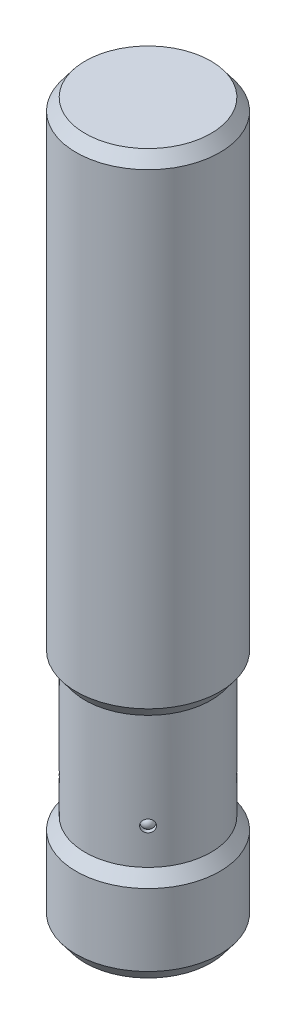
ISO-10303-21;
HEADER;
FILE_DESCRIPTION(('STEP AP214'),'2;1');
FILE_NAME('part.step','',(''),(''),'','','');
FILE_SCHEMA(('AUTOMOTIVE_DESIGN { 1 0 10303 214 1 1 1 1 }'));
ENDSEC;
DATA;
#1=APPLICATION_CONTEXT('core data for automotive mechanical design processes');
#2=APPLICATION_PROTOCOL_DEFINITION('international standard','automotive_design',2000,#1);
#3=PRODUCT_CONTEXT('',#1,'mechanical');
#4=PRODUCT('Part','Part','',(#3));
#5=PRODUCT_RELATED_PRODUCT_CATEGORY('part','',(#4));
#6=PRODUCT_DEFINITION_FORMATION('','',#4);
#7=PRODUCT_DEFINITION_CONTEXT('part definition',#1,'design');
#8=PRODUCT_DEFINITION('design','',#6,#7);
#9=PRODUCT_DEFINITION_SHAPE('','',#8);
#10=(LENGTH_UNIT() NAMED_UNIT(*) SI_UNIT(.MILLI.,.METRE.));
#11=(NAMED_UNIT(*) PLANE_ANGLE_UNIT() SI_UNIT($,.RADIAN.));
#12=(NAMED_UNIT(*) SI_UNIT($,.STERADIAN.) SOLID_ANGLE_UNIT());
#13=UNCERTAINTY_MEASURE_WITH_UNIT(LENGTH_MEASURE(1.E-05),#10,'distance_accuracy_value','');
#14=(GEOMETRIC_REPRESENTATION_CONTEXT(3) GLOBAL_UNCERTAINTY_ASSIGNED_CONTEXT((#13)) GLOBAL_UNIT_ASSIGNED_CONTEXT((#10,
#11,#12)) REPRESENTATION_CONTEXT('',''));
#15=CARTESIAN_POINT('',(0.,0.,0.));
#16=DIRECTION('',(0.,0.,1.));
#17=DIRECTION('',(1.,0.,0.));
#18=AXIS2_PLACEMENT_3D('',#15,#16,#17);
#19=CARTESIAN_POINT('',(5.12652416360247,-49.,-5.12652416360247));
#20=DIRECTION('',(-0.707106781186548,0.,0.707106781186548));
#21=DIRECTION('',(0.707106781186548,0.,0.707106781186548));
#22=AXIS2_PLACEMENT_3D('',#19,#20,#21);
#23=CYLINDRICAL_SURFACE('',#22,0.5);
#24=CARTESIAN_POINT('',(4.04898976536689,-49.,-3.34188298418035));
#25=CARTESIAN_POINT('',(4.04898851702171,-48.9720000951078,-3.34188493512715));
#26=CARTESIAN_POINT('',(4.04748142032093,-48.9439764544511,-3.34371311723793));
#27=CARTESIAN_POINT('',(4.04147412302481,-48.8886799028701,-3.35097120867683));
#28=CARTESIAN_POINT('',(4.03696762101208,-48.8614086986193,-3.3564087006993));
#29=CARTESIAN_POINT('',(4.02505422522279,-48.8084628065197,-3.37068604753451));
#30=CARTESIAN_POINT('',(4.01765015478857,-48.7827865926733,-3.37952259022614));
#31=CARTESIAN_POINT('',(4.00009662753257,-48.7337381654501,-3.40028098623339));
#32=CARTESIAN_POINT('',(3.98994837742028,-48.7103649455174,-3.41220148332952));
#33=CARTESIAN_POINT('',(3.96708199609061,-48.6664935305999,-3.43875959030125));
#34=CARTESIAN_POINT('',(3.95435615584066,-48.6460042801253,-3.45340533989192));
#35=CARTESIAN_POINT('',(3.92662928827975,-48.6085587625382,-3.48489909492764));
#36=CARTESIAN_POINT('',(3.91162804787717,-48.5916028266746,-3.50174730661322));
#37=CARTESIAN_POINT('',(3.87966391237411,-48.5616771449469,-3.53712828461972));
#38=CARTESIAN_POINT('',(3.86269738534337,-48.5487149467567,-3.55566415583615));
#39=CARTESIAN_POINT('',(3.82723947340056,-48.527193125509,-3.59380233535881));
#40=CARTESIAN_POINT('',(3.80874813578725,-48.5186333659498,-3.61340461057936));
#41=CARTESIAN_POINT('',(3.77077872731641,-48.5061845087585,-3.65300939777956));
#42=CARTESIAN_POINT('',(3.75130383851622,-48.5022812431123,-3.67301050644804));
#43=CARTESIAN_POINT('',(3.71184944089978,-48.4992123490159,-3.71287760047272));
#44=CARTESIAN_POINT('',(3.69186994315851,-48.5000466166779,-3.73274358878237));
#45=CARTESIAN_POINT('',(3.65204719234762,-48.5064175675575,-3.7717138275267));
#46=CARTESIAN_POINT('',(3.63220370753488,-48.5119389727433,-3.7908203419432));
#47=CARTESIAN_POINT('',(3.59317935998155,-48.5275037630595,-3.82783042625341));
#48=CARTESIAN_POINT('',(3.5739985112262,-48.5375472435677,-3.84573397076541));
#49=CARTESIAN_POINT('',(3.53686126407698,-48.5618883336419,-3.87991637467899));
#50=CARTESIAN_POINT('',(3.51890691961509,-48.5761928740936,-3.89619252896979));
#51=CARTESIAN_POINT('',(3.4848303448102,-48.608643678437,-3.92670107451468));
#52=CARTESIAN_POINT('',(3.46870801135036,-48.6267897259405,-3.94093358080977));
#53=CARTESIAN_POINT('',(3.43876588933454,-48.6664909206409,-3.96708793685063));
#54=CARTESIAN_POINT('',(3.42495503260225,-48.6880586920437,-3.97900085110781));
#55=CARTESIAN_POINT('',(3.40017462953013,-48.7339596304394,-4.00019742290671));
#56=CARTESIAN_POINT('',(3.38920640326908,-48.7582940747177,-4.00947985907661));
#57=CARTESIAN_POINT('',(3.37049477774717,-48.8090557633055,-4.02522237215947));
#58=CARTESIAN_POINT('',(3.36275462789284,-48.8354850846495,-4.03167960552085));
#59=CARTESIAN_POINT('',(3.35080848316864,-48.8896214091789,-4.04161404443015));
#60=CARTESIAN_POINT('',(3.34659498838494,-48.9173255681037,-4.04509757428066));
#61=CARTESIAN_POINT('',(3.34265918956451,-48.9634414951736,-4.04834926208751));
#62=CARTESIAN_POINT('',(3.34188171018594,-48.9817156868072,-4.04899058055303));
#63=CARTESIAN_POINT('',(3.34188493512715,-49.0279999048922,-4.04898851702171));
#64=CARTESIAN_POINT('',(3.34371311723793,-49.0560235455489,-4.04748142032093));
#65=CARTESIAN_POINT('',(3.35097120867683,-49.1113200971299,-4.04147412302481));
#66=CARTESIAN_POINT('',(3.3564087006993,-49.1385913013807,-4.03696762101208));
#67=CARTESIAN_POINT('',(3.37068604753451,-49.1915371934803,-4.02505422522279));
#68=CARTESIAN_POINT('',(3.37952259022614,-49.2172134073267,-4.01765015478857));
#69=CARTESIAN_POINT('',(3.40028098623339,-49.2662618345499,-4.00009662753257));
#70=CARTESIAN_POINT('',(3.41220148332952,-49.2896350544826,-3.98994837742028));
#71=CARTESIAN_POINT('',(3.43875959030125,-49.3335064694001,-3.96708199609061));
#72=CARTESIAN_POINT('',(3.45340533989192,-49.3539957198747,-3.95435615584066));
#73=CARTESIAN_POINT('',(3.48489909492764,-49.3914412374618,-3.92662928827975));
#74=CARTESIAN_POINT('',(3.50174730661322,-49.4083971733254,-3.91162804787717));
#75=CARTESIAN_POINT('',(3.53712828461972,-49.4383228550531,-3.87966391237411));
#76=CARTESIAN_POINT('',(3.55566415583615,-49.4512850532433,-3.86269738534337));
#77=CARTESIAN_POINT('',(3.59380233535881,-49.472806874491,-3.82723947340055));
#78=CARTESIAN_POINT('',(3.61340461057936,-49.4813666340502,-3.80874813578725));
#79=CARTESIAN_POINT('',(3.65300939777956,-49.4938154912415,-3.77077872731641));
#80=CARTESIAN_POINT('',(3.67301050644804,-49.4977187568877,-3.75130383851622));
#81=CARTESIAN_POINT('',(3.71287760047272,-49.5007876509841,-3.71184944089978));
#82=CARTESIAN_POINT('',(3.73274358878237,-49.4999533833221,-3.69186994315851));
#83=CARTESIAN_POINT('',(3.7717138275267,-49.4935824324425,-3.65204719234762));
#84=CARTESIAN_POINT('',(3.7908203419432,-49.4880610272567,-3.63220370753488));
#85=CARTESIAN_POINT('',(3.82783042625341,-49.4724962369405,-3.59317935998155));
#86=CARTESIAN_POINT('',(3.84573397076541,-49.4624527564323,-3.5739985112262));
#87=CARTESIAN_POINT('',(3.87991637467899,-49.4381116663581,-3.53686126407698));
#88=CARTESIAN_POINT('',(3.89619252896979,-49.4238071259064,-3.51890691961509));
#89=CARTESIAN_POINT('',(3.92670107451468,-49.391356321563,-3.4848303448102));
#90=CARTESIAN_POINT('',(3.94093358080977,-49.3732102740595,-3.46870801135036));
#91=CARTESIAN_POINT('',(3.96708793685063,-49.3335090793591,-3.43876588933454));
#92=CARTESIAN_POINT('',(3.97900085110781,-49.3119413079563,-3.42495503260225));
#93=CARTESIAN_POINT('',(4.00019742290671,-49.2660403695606,-3.40017462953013));
#94=CARTESIAN_POINT('',(4.00947985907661,-49.2417059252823,-3.38920640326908));
#95=CARTESIAN_POINT('',(4.02522237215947,-49.1909442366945,-3.37049477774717));
#96=CARTESIAN_POINT('',(4.03167960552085,-49.1645149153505,-3.36275462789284));
#97=CARTESIAN_POINT('',(4.04161404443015,-49.1103785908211,-3.35080848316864));
#98=CARTESIAN_POINT('',(4.04509757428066,-49.0826744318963,-3.34659498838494));
#99=CARTESIAN_POINT('',(4.04834926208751,-49.0365585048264,-3.34265918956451));
#100=CARTESIAN_POINT('',(4.04899058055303,-49.0182843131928,-3.34188171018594));
#101=CARTESIAN_POINT('',(4.04898976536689,-49.,-3.34188298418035));
#102=B_SPLINE_CURVE_WITH_KNOTS('',3,(#24,#25,#26,#27,#28,#29,#30,#31,#32,#33,#34,#35,#36,#37,
#38,#39,#40,#41,#42,#43,#44,#45,#46,#47,#48,#49,#50,#51,#52,#53,#54,#55,#56,#57,#58,#59,#60,#61,
#62,#63,#64,#65,#66,#67,#68,#69,#70,#71,#72,#73,#74,#75,#76,#77,#78,#79,#80,#81,#82,#83,#84,#85,
#86,#87,#88,#89,#90,#91,#92,#93,#94,#95,#96,#97,#98,#99,#100,#101),.UNSPECIFIED.,.T.,.F.,(4,2,2,
2,2,2,2,2,2,2,2,2,2,2,2,2,2,2,2,2,2,2,2,2,2,2,2,2,2,2,2,2,2,2,2,2,2,2,4),(0.,0.0839416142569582,
0.16806013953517,0.252096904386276,0.336096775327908,0.420351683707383,0.504614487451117,
0.589035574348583,0.673454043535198,0.75761499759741,0.841774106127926,0.925659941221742,
1.00954754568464,1.09357235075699,1.17759242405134,1.2619300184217,1.34630670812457,
1.43076812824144,1.51504946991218,1.56986446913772,1.65380608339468,1.73792460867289,
1.82196137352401,1.90596124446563,1.99021615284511,2.07447895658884,2.15890004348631,
2.24331851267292,2.32747946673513,2.41163857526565,2.49552441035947,2.57941201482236,
2.66343681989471,2.74745689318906,2.83179448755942,2.91617117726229,3.00063259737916,
3.0849139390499,3.13972893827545),.UNSPECIFIED.);
#103=CARTESIAN_POINT('',(4.04898976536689,-49.,-3.34188298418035));
#104=VERTEX_POINT('',#103);
#105=EDGE_CURVE('E95',#104,#104,#102,.T.);
#106=ORIENTED_EDGE('',*,*,#105,.F.);
#107=EDGE_LOOP('',(#106));
#108=FACE_BOUND('',#107,.T.);
#109=CARTESIAN_POINT('',(3.3587572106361,-49.,-3.3587572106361));
#110=DIRECTION('',(-0.707106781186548,0.,0.707106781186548));
#111=DIRECTION('',(0.707106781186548,0.,0.707106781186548));
#112=AXIS2_PLACEMENT_3D('',#109,#110,#111);
#113=CIRCLE('',#112,0.5);
#114=CARTESIAN_POINT('',(3.00520382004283,-49.,-3.71231060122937));
#115=VERTEX_POINT('',#114);
#116=EDGE_CURVE('E11',#115,#115,#113,.T.);
#117=ORIENTED_EDGE('',*,*,#116,.T.);
#118=EDGE_LOOP('',(#117));
#119=FACE_BOUND('',#118,.T.);
#120=ADVANCED_FACE('F16',(#108,#119),#23,.F.);
#121=CARTESIAN_POINT('',(-2.625,-60.,0.));
#122=DIRECTION('',(0.,-1.,0.));
#123=DIRECTION('',(0.,0.,-1.));
#124=AXIS2_PLACEMENT_3D('',#121,#122,#123);
#125=PLANE('',#124);
#126=CARTESIAN_POINT('',(0.,-60.0000000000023,0.));
#127=DIRECTION('',(0.,1.,0.));
#128=DIRECTION('',(0.,0.,1.));
#129=AXIS2_PLACEMENT_3D('',#126,#127,#128);
#130=CIRCLE('',#129,5.25000000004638);
#131=CARTESIAN_POINT('',(0.,-60.0000000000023,5.25000000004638));
#132=VERTEX_POINT('',#131);
#133=EDGE_CURVE('E93',#132,#132,#130,.T.);
#134=ORIENTED_EDGE('',*,*,#133,.F.);
#135=EDGE_LOOP('',(#134));
#136=FACE_BOUND('',#135,.T.);
#137=ADVANCED_FACE('F83',(#136),#125,.T.);
#138=CARTESIAN_POINT('',(0.,-59.0000000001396,0.));
#139=DIRECTION('',(0.,1.,0.));
#140=DIRECTION('',(0.,0.,1.));
#141=AXIS2_PLACEMENT_3D('',#138,#139,#140);
#142=CONICAL_SURFACE('',#141,5.99999999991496,0.643501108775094);
#143=ORIENTED_EDGE('',*,*,#133,.T.);
#144=EDGE_LOOP('',(#143));
#145=FACE_BOUND('',#144,.T.);
#146=CARTESIAN_POINT('',(0.,-59.,0.));
#147=DIRECTION('',(0.,-1.,0.));
#148=DIRECTION('',(0.,0.,-1.));
#149=AXIS2_PLACEMENT_3D('',#146,#147,#148);
#150=CIRCLE('',#149,6.);
#151=CARTESIAN_POINT('',(0.,-59.,-6.));
#152=VERTEX_POINT('',#151);
#153=EDGE_CURVE('E94',#152,#152,#150,.F.);
#154=ORIENTED_EDGE('',*,*,#153,.F.);
#155=EDGE_LOOP('',(#154));
#156=FACE_BOUND('',#155,.T.);
#157=ADVANCED_FACE('F80',(#145,#156),#142,.T.);
#158=CARTESIAN_POINT('',(-3.3587572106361,-49.,-3.3587572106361));
#159=DIRECTION('',(1.,0.,0.));
#160=DIRECTION('',(0.,1.,0.));
#161=AXIS2_PLACEMENT_3D('',#158,#159,#160);
#162=SPHERICAL_SURFACE('',#161,0.5);
#163=CARTESIAN_POINT('',(-3.8587572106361,-49.,-3.3587572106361));
#164=VERTEX_POINT('',#163);
#165=VERTEX_LOOP('',#164);
#166=FACE_BOUND('',#165,.T.);
#167=CARTESIAN_POINT('',(-3.3587572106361,-49.,-3.3587572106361));
#168=DIRECTION('',(0.707106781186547,0.,0.707106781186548));
#169=DIRECTION('',(0.707106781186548,0.,-0.707106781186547));
#170=AXIS2_PLACEMENT_3D('',#167,#168,#169);
#171=CIRCLE('',#170,0.5);
#172=CARTESIAN_POINT('',(-3.00520382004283,-49.,-3.71231060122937));
#173=VERTEX_POINT('',#172);
#174=EDGE_CURVE('E98',#173,#173,#171,.F.);
#175=ORIENTED_EDGE('',*,*,#174,.T.);
#176=EDGE_LOOP('',(#175));
#177=FACE_BOUND('',#176,.T.);
#178=ADVANCED_FACE('F54',(#166,#177),#162,.T.);
#179=CARTESIAN_POINT('',(0.,-56.,0.));
#180=DIRECTION('',(0.,-1.,0.));
#181=DIRECTION('',(0.,0.,-1.));
#182=AXIS2_PLACEMENT_3D('',#179,#180,#181);
#183=CYLINDRICAL_SURFACE('',#182,6.);
#184=ORIENTED_EDGE('',*,*,#153,.T.);
#185=EDGE_LOOP('',(#184));
#186=FACE_BOUND('',#185,.T.);
#187=CARTESIAN_POINT('',(0.,-52.9999999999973,0.));
#188=DIRECTION('',(0.,-1.,0.));
#189=DIRECTION('',(-1.,0.,0.));
#190=AXIS2_PLACEMENT_3D('',#187,#188,#189);
#191=CIRCLE('',#190,5.99999999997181);
#192=CARTESIAN_POINT('',(-5.99999999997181,-52.9999999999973,0.));
#193=VERTEX_POINT('',#192);
#194=EDGE_CURVE('E108',#193,#193,#191,.F.);
#195=ORIENTED_EDGE('',*,*,#194,.F.);
#196=EDGE_LOOP('',(#195));
#197=FACE_BOUND('',#196,.T.);
#198=ADVANCED_FACE('F43',(#186,#197),#183,.T.);
#199=CARTESIAN_POINT('',(3.3587572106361,-49.,3.3587572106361));
#200=DIRECTION('',(1.,0.,0.));
#201=DIRECTION('',(0.,1.,0.));
#202=AXIS2_PLACEMENT_3D('',#199,#200,#201);
#203=SPHERICAL_SURFACE('',#202,0.5);
#204=CARTESIAN_POINT('',(3.3587572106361,-49.,3.3587572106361));
#205=DIRECTION('',(-0.707106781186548,0.,-0.707106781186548));
#206=DIRECTION('',(-0.707106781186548,0.,0.707106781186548));
#207=AXIS2_PLACEMENT_3D('',#204,#205,#206);
#208=CIRCLE('',#207,0.5);
#209=CARTESIAN_POINT('',(3.00520382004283,-49.,3.71231060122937));
#210=VERTEX_POINT('',#209);
#211=EDGE_CURVE('E111',#210,#210,#208,.F.);
#212=ORIENTED_EDGE('',*,*,#211,.T.);
#213=EDGE_LOOP('',(#212));
#214=FACE_BOUND('',#213,.T.);
#215=CARTESIAN_POINT('',(3.8587572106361,-49.,3.3587572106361));
#216=VERTEX_POINT('',#215);
#217=VERTEX_LOOP('',#216);
#218=FACE_BOUND('',#217,.T.);
#219=ADVANCED_FACE('F40',(#214,#218),#203,.T.);
#220=CARTESIAN_POINT('',(-3.3587572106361,-49.,3.3587572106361));
#221=DIRECTION('',(1.,0.,0.));
#222=DIRECTION('',(0.,1.,0.));
#223=AXIS2_PLACEMENT_3D('',#220,#221,#222);
#224=SPHERICAL_SURFACE('',#223,0.5);
#225=CARTESIAN_POINT('',(-3.3587572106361,-49.,3.3587572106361));
#226=DIRECTION('',(0.707106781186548,0.,-0.707106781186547));
#227=DIRECTION('',(-0.707106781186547,0.,-0.707106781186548));
#228=AXIS2_PLACEMENT_3D('',#225,#226,#227);
#229=CIRCLE('',#228,0.5);
#230=CARTESIAN_POINT('',(-3.71231060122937,-49.,3.00520382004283));
#231=VERTEX_POINT('',#230);
#232=EDGE_CURVE('E113',#231,#231,#229,.F.);
#233=ORIENTED_EDGE('',*,*,#232,.T.);
#234=EDGE_LOOP('',(#233));
#235=FACE_BOUND('',#234,.T.);
#236=CARTESIAN_POINT('',(-3.8587572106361,-49.,3.3587572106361));
#237=VERTEX_POINT('',#236);
#238=VERTEX_LOOP('',#237);
#239=FACE_BOUND('',#238,.T.);
#240=ADVANCED_FACE('F42',(#235,#239),#224,.T.);
#241=CARTESIAN_POINT('',(-5.12652416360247,-49.,-5.12652416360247));
#242=DIRECTION('',(0.707106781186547,0.,0.707106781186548));
#243=DIRECTION('',(0.707106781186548,0.,-0.707106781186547));
#244=AXIS2_PLACEMENT_3D('',#241,#242,#243);
#245=CYLINDRICAL_SURFACE('',#244,0.5);
#246=CARTESIAN_POINT('',(-3.34188298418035,-49.,-4.04898976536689));
#247=CARTESIAN_POINT('',(-3.34188493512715,-48.9720000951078,-4.04898851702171));
#248=CARTESIAN_POINT('',(-3.34371311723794,-48.9439764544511,-4.04748142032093));
#249=CARTESIAN_POINT('',(-3.35097120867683,-48.8886799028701,-4.04147412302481));
#250=CARTESIAN_POINT('',(-3.3564087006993,-48.8614086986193,-4.03696762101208));
#251=CARTESIAN_POINT('',(-3.37068604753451,-48.8084628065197,-4.02505422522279));
#252=CARTESIAN_POINT('',(-3.37952259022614,-48.7827865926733,-4.01765015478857));
#253=CARTESIAN_POINT('',(-3.40028098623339,-48.7337381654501,-4.00009662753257));
#254=CARTESIAN_POINT('',(-3.41220148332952,-48.7103649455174,-3.98994837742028));
#255=CARTESIAN_POINT('',(-3.43875959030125,-48.6664935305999,-3.96708199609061));
#256=CARTESIAN_POINT('',(-3.45340533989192,-48.6460042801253,-3.95435615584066));
#257=CARTESIAN_POINT('',(-3.48489909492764,-48.6085587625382,-3.92662928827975));
#258=CARTESIAN_POINT('',(-3.50174730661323,-48.5916028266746,-3.91162804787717));
#259=CARTESIAN_POINT('',(-3.53712828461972,-48.5616771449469,-3.87966391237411));
#260=CARTESIAN_POINT('',(-3.55566415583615,-48.5487149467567,-3.86269738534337));
#261=CARTESIAN_POINT('',(-3.59380233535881,-48.527193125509,-3.82723947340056));
#262=CARTESIAN_POINT('',(-3.61340461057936,-48.5186333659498,-3.80874813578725));
#263=CARTESIAN_POINT('',(-3.65300939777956,-48.5061845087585,-3.77077872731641));
#264=CARTESIAN_POINT('',(-3.67301050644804,-48.5022812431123,-3.75130383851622));
#265=CARTESIAN_POINT('',(-3.71287760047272,-48.4992123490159,-3.71184944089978));
#266=CARTESIAN_POINT('',(-3.73274358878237,-48.5000466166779,-3.69186994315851));
#267=CARTESIAN_POINT('',(-3.7717138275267,-48.5064175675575,-3.65204719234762));
#268=CARTESIAN_POINT('',(-3.7908203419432,-48.5119389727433,-3.63220370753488));
#269=CARTESIAN_POINT('',(-3.82783042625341,-48.5275037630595,-3.59317935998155));
#270=CARTESIAN_POINT('',(-3.84573397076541,-48.5375472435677,-3.5739985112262));
#271=CARTESIAN_POINT('',(-3.87991637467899,-48.5618883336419,-3.53686126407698));
#272=CARTESIAN_POINT('',(-3.89619252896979,-48.5761928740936,-3.51890691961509));
#273=CARTESIAN_POINT('',(-3.92670107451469,-48.608643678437,-3.4848303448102));
#274=CARTESIAN_POINT('',(-3.94093358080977,-48.6267897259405,-3.46870801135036));
#275=CARTESIAN_POINT('',(-3.96708793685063,-48.6664909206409,-3.43876588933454));
#276=CARTESIAN_POINT('',(-3.97900085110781,-48.6880586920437,-3.42495503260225));
#277=CARTESIAN_POINT('',(-4.00019742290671,-48.7339596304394,-3.40017462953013));
#278=CARTESIAN_POINT('',(-4.00947985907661,-48.7582940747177,-3.38920640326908));
#279=CARTESIAN_POINT('',(-4.02522237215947,-48.8090557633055,-3.37049477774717));
#280=CARTESIAN_POINT('',(-4.03167960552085,-48.8354850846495,-3.36275462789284));
#281=CARTESIAN_POINT('',(-4.04161404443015,-48.8896214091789,-3.35080848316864));
#282=CARTESIAN_POINT('',(-4.04509757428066,-48.9173255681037,-3.34659498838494));
#283=CARTESIAN_POINT('',(-4.04834926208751,-48.9634414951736,-3.34265918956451));
#284=CARTESIAN_POINT('',(-4.04899058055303,-48.9817156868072,-3.34188171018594));
#285=CARTESIAN_POINT('',(-4.04898851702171,-49.0279999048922,-3.34188493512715));
#286=CARTESIAN_POINT('',(-4.04748142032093,-49.0560235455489,-3.34371311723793));
#287=CARTESIAN_POINT('',(-4.04147412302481,-49.1113200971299,-3.35097120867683));
#288=CARTESIAN_POINT('',(-4.03696762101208,-49.1385913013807,-3.35640870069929));
#289=CARTESIAN_POINT('',(-4.02505422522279,-49.1915371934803,-3.37068604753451));
#290=CARTESIAN_POINT('',(-4.01765015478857,-49.2172134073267,-3.37952259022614));
#291=CARTESIAN_POINT('',(-4.00009662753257,-49.2662618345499,-3.40028098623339));
#292=CARTESIAN_POINT('',(-3.98994837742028,-49.2896350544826,-3.41220148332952));
#293=CARTESIAN_POINT('',(-3.96708199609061,-49.3335064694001,-3.43875959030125));
#294=CARTESIAN_POINT('',(-3.95435615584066,-49.3539957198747,-3.45340533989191));
#295=CARTESIAN_POINT('',(-3.92662928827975,-49.3914412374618,-3.48489909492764));
#296=CARTESIAN_POINT('',(-3.91162804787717,-49.4083971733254,-3.50174730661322));
#297=CARTESIAN_POINT('',(-3.87966391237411,-49.4383228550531,-3.53712828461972));
#298=CARTESIAN_POINT('',(-3.86269738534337,-49.4512850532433,-3.55566415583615));
#299=CARTESIAN_POINT('',(-3.82723947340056,-49.472806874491,-3.59380233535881));
#300=CARTESIAN_POINT('',(-3.80874813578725,-49.4813666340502,-3.61340461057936));
#301=CARTESIAN_POINT('',(-3.77077872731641,-49.4938154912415,-3.65300939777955));
#302=CARTESIAN_POINT('',(-3.75130383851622,-49.4977187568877,-3.67301050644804));
#303=CARTESIAN_POINT('',(-3.71184944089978,-49.5007876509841,-3.71287760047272));
#304=CARTESIAN_POINT('',(-3.69186994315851,-49.4999533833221,-3.73274358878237));
#305=CARTESIAN_POINT('',(-3.65204719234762,-49.4935824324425,-3.77171382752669));
#306=CARTESIAN_POINT('',(-3.63220370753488,-49.4880610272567,-3.7908203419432));
#307=CARTESIAN_POINT('',(-3.59317935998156,-49.4724962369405,-3.82783042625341));
#308=CARTESIAN_POINT('',(-3.57399851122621,-49.4624527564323,-3.84573397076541));
#309=CARTESIAN_POINT('',(-3.53686126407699,-49.4381116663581,-3.87991637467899));
#310=CARTESIAN_POINT('',(-3.51890691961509,-49.4238071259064,-3.89619252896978));
#311=CARTESIAN_POINT('',(-3.48483034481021,-49.3913563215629,-3.92670107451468));
#312=CARTESIAN_POINT('',(-3.46870801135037,-49.3732102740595,-3.94093358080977));
#313=CARTESIAN_POINT('',(-3.43876588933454,-49.3335090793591,-3.96708793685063));
#314=CARTESIAN_POINT('',(-3.42495503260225,-49.3119413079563,-3.97900085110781));
#315=CARTESIAN_POINT('',(-3.40017462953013,-49.2660403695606,-4.00019742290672));
#316=CARTESIAN_POINT('',(-3.38920640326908,-49.2417059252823,-4.00947985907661));
#317=CARTESIAN_POINT('',(-3.37049477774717,-49.1909442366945,-4.02522237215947));
#318=CARTESIAN_POINT('',(-3.36275462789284,-49.1645149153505,-4.03167960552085));
#319=CARTESIAN_POINT('',(-3.35080848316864,-49.1103785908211,-4.04161404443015));
#320=CARTESIAN_POINT('',(-3.34659498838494,-49.0826744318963,-4.04509757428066));
#321=CARTESIAN_POINT('',(-3.34265918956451,-49.0365585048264,-4.0483492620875));
#322=CARTESIAN_POINT('',(-3.34188171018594,-49.0182843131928,-4.04899058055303));
#323=CARTESIAN_POINT('',(-3.34188298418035,-49.,-4.04898976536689));
#324=B_SPLINE_CURVE_WITH_KNOTS('',3,(#246,#247,#248,#249,#250,#251,#252,#253,#254,#255,#256,
#257,#258,#259,#260,#261,#262,#263,#264,#265,#266,#267,#268,#269,#270,#271,#272,#273,#274,#275,
#276,#277,#278,#279,#280,#281,#282,#283,#284,#285,#286,#287,#288,#289,#290,#291,#292,#293,#294,
#295,#296,#297,#298,#299,#300,#301,#302,#303,#304,#305,#306,#307,#308,#309,#310,#311,#312,#313,
#314,#315,#316,#317,#318,#319,#320,#321,#322,#323),.UNSPECIFIED.,.T.,.F.,(4,2,2,2,2,2,2,2,2,2,2,
2,2,2,2,2,2,2,2,2,2,2,2,2,2,2,2,2,2,2,2,2,2,2,2,2,2,2,4),(0.,0.0839416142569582,
0.16806013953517,0.252096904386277,0.336096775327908,0.420351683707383,0.504614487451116,
0.589035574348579,0.673454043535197,0.757614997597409,0.841774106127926,0.92565994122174,
1.00954754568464,1.09357235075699,1.17759242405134,1.2619300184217,1.34630670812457,
1.43076812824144,1.51504946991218,1.56986446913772,1.65380608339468,1.73792460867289,
1.82196137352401,1.90596124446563,1.99021615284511,2.07447895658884,2.15890004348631,
2.24331851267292,2.32747946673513,2.41163857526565,2.49552441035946,2.57941201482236,
2.66343681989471,2.74745689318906,2.83179448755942,2.9161711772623,3.00063259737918,
3.08491393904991,3.13972893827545),.UNSPECIFIED.);
#325=CARTESIAN_POINT('',(-3.34188298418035,-49.,-4.04898976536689));
#326=VERTEX_POINT('',#325);
#327=EDGE_CURVE('E116',#326,#326,#324,.T.);
#328=ORIENTED_EDGE('',*,*,#327,.F.);
#329=EDGE_LOOP('',(#328));
#330=FACE_BOUND('',#329,.T.);
#331=ORIENTED_EDGE('',*,*,#174,.F.);
#332=EDGE_LOOP('',(#331));
#333=FACE_BOUND('',#332,.T.);
#334=ADVANCED_FACE('F51',(#330,#333),#245,.F.);
#335=CARTESIAN_POINT('',(0.,-52.9999999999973,0.));
#336=DIRECTION('',(0.,-1.,0.));
#337=DIRECTION('',(0.,0.,-1.));
#338=AXIS2_PLACEMENT_3D('',#335,#336,#337);
#339=CONICAL_SURFACE('',#338,5.99999999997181,0.643501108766);
#340=ORIENTED_EDGE('',*,*,#194,.T.);
#341=EDGE_LOOP('',(#340));
#342=FACE_BOUND('',#341,.T.);
#343=CARTESIAN_POINT('',(0.,-52.,0.));
#344=DIRECTION('',(0.,-1.,0.));
#345=DIRECTION('',(0.,0.,-1.));
#346=AXIS2_PLACEMENT_3D('',#343,#344,#345);
#347=CIRCLE('',#346,5.25);
#348=CARTESIAN_POINT('',(0.,-52.,-5.25));
#349=VERTEX_POINT('',#348);
#350=EDGE_CURVE('E122',#349,#349,#347,.F.);
#351=ORIENTED_EDGE('',*,*,#350,.F.);
#352=EDGE_LOOP('',(#351));
#353=FACE_BOUND('',#352,.T.);
#354=ADVANCED_FACE('F152',(#342,#353),#339,.T.);
#355=CARTESIAN_POINT('',(5.12652416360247,-49.,5.12652416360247));
#356=DIRECTION('',(-0.707106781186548,0.,-0.707106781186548));
#357=DIRECTION('',(-0.707106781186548,0.,0.707106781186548));
#358=AXIS2_PLACEMENT_3D('',#355,#356,#357);
#359=CYLINDRICAL_SURFACE('',#358,0.5);
#360=CARTESIAN_POINT('',(3.34188298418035,-49.,4.04898976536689));
#361=CARTESIAN_POINT('',(3.34188493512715,-48.9720000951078,4.04898851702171));
#362=CARTESIAN_POINT('',(3.34371311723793,-48.9439764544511,4.04748142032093));
#363=CARTESIAN_POINT('',(3.35097120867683,-48.8886799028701,4.04147412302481));
#364=CARTESIAN_POINT('',(3.3564087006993,-48.8614086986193,4.03696762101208));
#365=CARTESIAN_POINT('',(3.37068604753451,-48.8084628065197,4.02505422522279));
#366=CARTESIAN_POINT('',(3.37952259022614,-48.7827865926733,4.01765015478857));
#367=CARTESIAN_POINT('',(3.40028098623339,-48.7337381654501,4.00009662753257));
#368=CARTESIAN_POINT('',(3.41220148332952,-48.7103649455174,3.98994837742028));
#369=CARTESIAN_POINT('',(3.43875959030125,-48.6664935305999,3.96708199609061));
#370=CARTESIAN_POINT('',(3.45340533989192,-48.6460042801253,3.95435615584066));
#371=CARTESIAN_POINT('',(3.48489909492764,-48.6085587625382,3.92662928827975));
#372=CARTESIAN_POINT('',(3.50174730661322,-48.5916028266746,3.91162804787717));
#373=CARTESIAN_POINT('',(3.53712828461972,-48.5616771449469,3.87966391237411));
#374=CARTESIAN_POINT('',(3.55566415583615,-48.5487149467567,3.86269738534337));
#375=CARTESIAN_POINT('',(3.59380233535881,-48.527193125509,3.82723947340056));
#376=CARTESIAN_POINT('',(3.61340461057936,-48.5186333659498,3.80874813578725));
#377=CARTESIAN_POINT('',(3.65300939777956,-48.5061845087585,3.77077872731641));
#378=CARTESIAN_POINT('',(3.67301050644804,-48.5022812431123,3.75130383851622));
#379=CARTESIAN_POINT('',(3.71287760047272,-48.4992123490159,3.71184944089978));
#380=CARTESIAN_POINT('',(3.73274358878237,-48.5000466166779,3.69186994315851));
#381=CARTESIAN_POINT('',(3.7717138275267,-48.5064175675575,3.65204719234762));
#382=CARTESIAN_POINT('',(3.7908203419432,-48.5119389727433,3.63220370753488));
#383=CARTESIAN_POINT('',(3.82783042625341,-48.5275037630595,3.59317935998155));
#384=CARTESIAN_POINT('',(3.84573397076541,-48.5375472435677,3.5739985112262));
#385=CARTESIAN_POINT('',(3.87991637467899,-48.5618883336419,3.53686126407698));
#386=CARTESIAN_POINT('',(3.89619252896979,-48.5761928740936,3.51890691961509));
#387=CARTESIAN_POINT('',(3.92670107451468,-48.608643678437,3.4848303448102));
#388=CARTESIAN_POINT('',(3.94093358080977,-48.6267897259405,3.46870801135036));
#389=CARTESIAN_POINT('',(3.96708793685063,-48.6664909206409,3.43876588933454));
#390=CARTESIAN_POINT('',(3.97900085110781,-48.6880586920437,3.42495503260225));
#391=CARTESIAN_POINT('',(4.00019742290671,-48.7339596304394,3.40017462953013));
#392=CARTESIAN_POINT('',(4.00947985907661,-48.7582940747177,3.38920640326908));
#393=CARTESIAN_POINT('',(4.02522237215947,-48.8090557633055,3.37049477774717));
#394=CARTESIAN_POINT('',(4.03167960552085,-48.8354850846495,3.36275462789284));
#395=CARTESIAN_POINT('',(4.04161404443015,-48.8896214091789,3.35080848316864));
#396=CARTESIAN_POINT('',(4.04509757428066,-48.9173255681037,3.34659498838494));
#397=CARTESIAN_POINT('',(4.04834926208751,-48.9634414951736,3.34265918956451));
#398=CARTESIAN_POINT('',(4.04899058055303,-48.9817156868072,3.34188171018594));
#399=CARTESIAN_POINT('',(4.04898851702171,-49.0279999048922,3.34188493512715));
#400=CARTESIAN_POINT('',(4.04748142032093,-49.0560235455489,3.34371311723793));
#401=CARTESIAN_POINT('',(4.04147412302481,-49.1113200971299,3.35097120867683));
#402=CARTESIAN_POINT('',(4.03696762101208,-49.1385913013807,3.3564087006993));
#403=CARTESIAN_POINT('',(4.02505422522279,-49.1915371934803,3.37068604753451));
#404=CARTESIAN_POINT('',(4.01765015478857,-49.2172134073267,3.37952259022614));
#405=CARTESIAN_POINT('',(4.00009662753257,-49.2662618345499,3.40028098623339));
#406=CARTESIAN_POINT('',(3.98994837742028,-49.2896350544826,3.41220148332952));
#407=CARTESIAN_POINT('',(3.96708199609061,-49.3335064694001,3.43875959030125));
#408=CARTESIAN_POINT('',(3.95435615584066,-49.3539957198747,3.45340533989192));
#409=CARTESIAN_POINT('',(3.92662928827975,-49.3914412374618,3.48489909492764));
#410=CARTESIAN_POINT('',(3.91162804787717,-49.4083971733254,3.50174730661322));
#411=CARTESIAN_POINT('',(3.87966391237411,-49.4383228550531,3.53712828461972));
#412=CARTESIAN_POINT('',(3.86269738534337,-49.4512850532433,3.55566415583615));
#413=CARTESIAN_POINT('',(3.82723947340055,-49.472806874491,3.59380233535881));
#414=CARTESIAN_POINT('',(3.80874813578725,-49.4813666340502,3.61340461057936));
#415=CARTESIAN_POINT('',(3.77077872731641,-49.4938154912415,3.65300939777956));
#416=CARTESIAN_POINT('',(3.75130383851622,-49.4977187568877,3.67301050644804));
#417=CARTESIAN_POINT('',(3.71184944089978,-49.5007876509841,3.71287760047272));
#418=CARTESIAN_POINT('',(3.69186994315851,-49.4999533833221,3.73274358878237));
#419=CARTESIAN_POINT('',(3.65204719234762,-49.4935824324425,3.77171382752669));
#420=CARTESIAN_POINT('',(3.63220370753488,-49.4880610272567,3.7908203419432));
#421=CARTESIAN_POINT('',(3.59317935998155,-49.4724962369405,3.82783042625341));
#422=CARTESIAN_POINT('',(3.5739985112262,-49.4624527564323,3.84573397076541));
#423=CARTESIAN_POINT('',(3.53686126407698,-49.4381116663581,3.87991637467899));
#424=CARTESIAN_POINT('',(3.51890691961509,-49.4238071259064,3.89619252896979));
#425=CARTESIAN_POINT('',(3.4848303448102,-49.391356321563,3.92670107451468));
#426=CARTESIAN_POINT('',(3.46870801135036,-49.3732102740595,3.94093358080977));
#427=CARTESIAN_POINT('',(3.43876588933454,-49.3335090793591,3.96708793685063));
#428=CARTESIAN_POINT('',(3.42495503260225,-49.3119413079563,3.97900085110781));
#429=CARTESIAN_POINT('',(3.40017462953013,-49.2660403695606,4.00019742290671));
#430=CARTESIAN_POINT('',(3.38920640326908,-49.2417059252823,4.00947985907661));
#431=CARTESIAN_POINT('',(3.37049477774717,-49.1909442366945,4.02522237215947));
#432=CARTESIAN_POINT('',(3.36275462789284,-49.1645149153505,4.03167960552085));
#433=CARTESIAN_POINT('',(3.35080848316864,-49.1103785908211,4.04161404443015));
#434=CARTESIAN_POINT('',(3.34659498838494,-49.0826744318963,4.04509757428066));
#435=CARTESIAN_POINT('',(3.34265918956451,-49.0365585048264,4.04834926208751));
#436=CARTESIAN_POINT('',(3.34188171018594,-49.0182843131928,4.04899058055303));
#437=CARTESIAN_POINT('',(3.34188298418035,-49.,4.04898976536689));
#438=B_SPLINE_CURVE_WITH_KNOTS('',3,(#360,#361,#362,#363,#364,#365,#366,#367,#368,#369,#370,
#371,#372,#373,#374,#375,#376,#377,#378,#379,#380,#381,#382,#383,#384,#385,#386,#387,#388,#389,
#390,#391,#392,#393,#394,#395,#396,#397,#398,#399,#400,#401,#402,#403,#404,#405,#406,#407,#408,
#409,#410,#411,#412,#413,#414,#415,#416,#417,#418,#419,#420,#421,#422,#423,#424,#425,#426,#427,
#428,#429,#430,#431,#432,#433,#434,#435,#436,#437),.UNSPECIFIED.,.T.,.F.,(4,2,2,2,2,2,2,2,2,2,2,
2,2,2,2,2,2,2,2,2,2,2,2,2,2,2,2,2,2,2,2,2,2,2,2,2,2,2,4),(0.,0.0839416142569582,
0.16806013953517,0.252096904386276,0.336096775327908,0.420351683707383,0.504614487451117,
0.589035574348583,0.673454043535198,0.75761499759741,0.841774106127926,0.925659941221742,
1.00954754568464,1.09357235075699,1.17759242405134,1.2619300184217,1.34630670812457,
1.43076812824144,1.51504946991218,1.56986446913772,1.65380608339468,1.73792460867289,
1.82196137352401,1.90596124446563,1.99021615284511,2.07447895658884,2.15890004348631,
2.24331851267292,2.32747946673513,2.41163857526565,2.49552441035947,2.57941201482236,
2.66343681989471,2.74745689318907,2.83179448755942,2.91617117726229,3.00063259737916,
3.0849139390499,3.13972893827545),.UNSPECIFIED.);
#439=CARTESIAN_POINT('',(3.34188298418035,-49.,4.04898976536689));
#440=VERTEX_POINT('',#439);
#441=EDGE_CURVE('E141',#440,#440,#438,.T.);
#442=ORIENTED_EDGE('',*,*,#441,.F.);
#443=EDGE_LOOP('',(#442));
#444=FACE_BOUND('',#443,.T.);
#445=ORIENTED_EDGE('',*,*,#211,.F.);
#446=EDGE_LOOP('',(#445));
#447=FACE_BOUND('',#446,.T.);
#448=ADVANCED_FACE('F149',(#444,#447),#359,.F.);
#449=CARTESIAN_POINT('',(-5.12652416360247,-49.,5.12652416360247));
#450=DIRECTION('',(0.707106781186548,0.,-0.707106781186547));
#451=DIRECTION('',(-0.707106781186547,0.,-0.707106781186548));
#452=AXIS2_PLACEMENT_3D('',#449,#450,#451);
#453=CYLINDRICAL_SURFACE('',#452,0.5);
#454=CARTESIAN_POINT('',(-4.04898976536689,-49.,3.34188298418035));
#455=CARTESIAN_POINT('',(-4.04898851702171,-48.9720000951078,3.34188493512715));
#456=CARTESIAN_POINT('',(-4.04748142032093,-48.9439764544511,3.34371311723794));
#457=CARTESIAN_POINT('',(-4.04147412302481,-48.8886799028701,3.35097120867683));
#458=CARTESIAN_POINT('',(-4.03696762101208,-48.8614086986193,3.3564087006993));
#459=CARTESIAN_POINT('',(-4.02505422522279,-48.8084628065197,3.37068604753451));
#460=CARTESIAN_POINT('',(-4.01765015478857,-48.7827865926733,3.37952259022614));
#461=CARTESIAN_POINT('',(-4.00009662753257,-48.7337381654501,3.40028098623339));
#462=CARTESIAN_POINT('',(-3.98994837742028,-48.7103649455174,3.41220148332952));
#463=CARTESIAN_POINT('',(-3.96708199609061,-48.6664935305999,3.43875959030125));
#464=CARTESIAN_POINT('',(-3.95435615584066,-48.6460042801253,3.45340533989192));
#465=CARTESIAN_POINT('',(-3.92662928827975,-48.6085587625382,3.48489909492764));
#466=CARTESIAN_POINT('',(-3.91162804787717,-48.5916028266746,3.50174730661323));
#467=CARTESIAN_POINT('',(-3.87966391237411,-48.5616771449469,3.53712828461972));
#468=CARTESIAN_POINT('',(-3.86269738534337,-48.5487149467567,3.55566415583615));
#469=CARTESIAN_POINT('',(-3.82723947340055,-48.527193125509,3.59380233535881));
#470=CARTESIAN_POINT('',(-3.80874813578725,-48.5186333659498,3.61340461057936));
#471=CARTESIAN_POINT('',(-3.77077872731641,-48.5061845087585,3.65300939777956));
#472=CARTESIAN_POINT('',(-3.75130383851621,-48.5022812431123,3.67301050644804));
#473=CARTESIAN_POINT('',(-3.71184944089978,-48.4992123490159,3.71287760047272));
#474=CARTESIAN_POINT('',(-3.69186994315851,-48.5000466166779,3.73274358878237));
#475=CARTESIAN_POINT('',(-3.65204719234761,-48.5064175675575,3.7717138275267));
#476=CARTESIAN_POINT('',(-3.63220370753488,-48.5119389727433,3.7908203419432));
#477=CARTESIAN_POINT('',(-3.59317935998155,-48.5275037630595,3.82783042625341));
#478=CARTESIAN_POINT('',(-3.5739985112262,-48.5375472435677,3.84573397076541));
#479=CARTESIAN_POINT('',(-3.53686126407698,-48.5618883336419,3.87991637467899));
#480=CARTESIAN_POINT('',(-3.51890691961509,-48.5761928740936,3.89619252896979));
#481=CARTESIAN_POINT('',(-3.4848303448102,-48.608643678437,3.92670107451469));
#482=CARTESIAN_POINT('',(-3.46870801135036,-48.6267897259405,3.94093358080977));
#483=CARTESIAN_POINT('',(-3.43876588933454,-48.6664909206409,3.96708793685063));
#484=CARTESIAN_POINT('',(-3.42495503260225,-48.6880586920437,3.97900085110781));
#485=CARTESIAN_POINT('',(-3.40017462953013,-48.7339596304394,4.00019742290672));
#486=CARTESIAN_POINT('',(-3.38920640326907,-48.7582940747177,4.00947985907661));
#487=CARTESIAN_POINT('',(-3.37049477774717,-48.8090557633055,4.02522237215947));
#488=CARTESIAN_POINT('',(-3.36275462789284,-48.8354850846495,4.03167960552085));
#489=CARTESIAN_POINT('',(-3.35080848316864,-48.8896214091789,4.04161404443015));
#490=CARTESIAN_POINT('',(-3.34659498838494,-48.9173255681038,4.04509757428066));
#491=CARTESIAN_POINT('',(-3.34265918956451,-48.9634414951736,4.04834926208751));
#492=CARTESIAN_POINT('',(-3.34188171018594,-48.9817156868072,4.04899058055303));
#493=CARTESIAN_POINT('',(-3.34188493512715,-49.0279999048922,4.04898851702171));
#494=CARTESIAN_POINT('',(-3.34371311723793,-49.0560235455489,4.04748142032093));
#495=CARTESIAN_POINT('',(-3.35097120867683,-49.1113200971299,4.04147412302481));
#496=CARTESIAN_POINT('',(-3.35640870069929,-49.1385913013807,4.03696762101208));
#497=CARTESIAN_POINT('',(-3.37068604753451,-49.1915371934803,4.02505422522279));
#498=CARTESIAN_POINT('',(-3.37952259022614,-49.2172134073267,4.01765015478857));
#499=CARTESIAN_POINT('',(-3.40028098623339,-49.2662618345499,4.00009662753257));
#500=CARTESIAN_POINT('',(-3.41220148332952,-49.2896350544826,3.98994837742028));
#501=CARTESIAN_POINT('',(-3.43875959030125,-49.3335064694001,3.96708199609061));
#502=CARTESIAN_POINT('',(-3.45340533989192,-49.3539957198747,3.95435615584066));
#503=CARTESIAN_POINT('',(-3.48489909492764,-49.3914412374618,3.92662928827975));
#504=CARTESIAN_POINT('',(-3.50174730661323,-49.4083971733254,3.91162804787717));
#505=CARTESIAN_POINT('',(-3.53712828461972,-49.4383228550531,3.87966391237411));
#506=CARTESIAN_POINT('',(-3.55566415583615,-49.4512850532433,3.86269738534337));
#507=CARTESIAN_POINT('',(-3.59380233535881,-49.472806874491,3.82723947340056));
#508=CARTESIAN_POINT('',(-3.61340461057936,-49.4813666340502,3.80874813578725));
#509=CARTESIAN_POINT('',(-3.65300939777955,-49.4938154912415,3.77077872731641));
#510=CARTESIAN_POINT('',(-3.67301050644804,-49.4977187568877,3.75130383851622));
#511=CARTESIAN_POINT('',(-3.71287760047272,-49.5007876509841,3.71184944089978));
#512=CARTESIAN_POINT('',(-3.73274358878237,-49.4999533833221,3.69186994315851));
#513=CARTESIAN_POINT('',(-3.77171382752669,-49.4935824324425,3.65204719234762));
#514=CARTESIAN_POINT('',(-3.7908203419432,-49.4880610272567,3.63220370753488));
#515=CARTESIAN_POINT('',(-3.82783042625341,-49.4724962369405,3.59317935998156));
#516=CARTESIAN_POINT('',(-3.84573397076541,-49.4624527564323,3.57399851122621));
#517=CARTESIAN_POINT('',(-3.87991637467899,-49.4381116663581,3.53686126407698));
#518=CARTESIAN_POINT('',(-3.89619252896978,-49.4238071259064,3.51890691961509));
#519=CARTESIAN_POINT('',(-3.92670107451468,-49.391356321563,3.48483034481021));
#520=CARTESIAN_POINT('',(-3.94093358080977,-49.3732102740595,3.46870801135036));
#521=CARTESIAN_POINT('',(-3.96708793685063,-49.3335090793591,3.43876588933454));
#522=CARTESIAN_POINT('',(-3.97900085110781,-49.3119413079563,3.42495503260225));
#523=CARTESIAN_POINT('',(-4.00019742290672,-49.2660403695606,3.40017462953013));
#524=CARTESIAN_POINT('',(-4.00947985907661,-49.2417059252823,3.38920640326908));
#525=CARTESIAN_POINT('',(-4.02522237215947,-49.1909442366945,3.37049477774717));
#526=CARTESIAN_POINT('',(-4.03167960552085,-49.1645149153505,3.36275462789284));
#527=CARTESIAN_POINT('',(-4.04161404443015,-49.1103785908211,3.35080848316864));
#528=CARTESIAN_POINT('',(-4.04509757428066,-49.0826744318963,3.34659498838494));
#529=CARTESIAN_POINT('',(-4.0483492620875,-49.0365585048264,3.34265918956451));
#530=CARTESIAN_POINT('',(-4.04899058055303,-49.0182843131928,3.34188171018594));
#531=CARTESIAN_POINT('',(-4.04898976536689,-49.,3.34188298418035));
#532=B_SPLINE_CURVE_WITH_KNOTS('',3,(#454,#455,#456,#457,#458,#459,#460,#461,#462,#463,#464,
#465,#466,#467,#468,#469,#470,#471,#472,#473,#474,#475,#476,#477,#478,#479,#480,#481,#482,#483,
#484,#485,#486,#487,#488,#489,#490,#491,#492,#493,#494,#495,#496,#497,#498,#499,#500,#501,#502,
#503,#504,#505,#506,#507,#508,#509,#510,#511,#512,#513,#514,#515,#516,#517,#518,#519,#520,#521,
#522,#523,#524,#525,#526,#527,#528,#529,#530,#531),.UNSPECIFIED.,.T.,.F.,(4,2,2,2,2,2,2,2,2,2,2,
2,2,2,2,2,2,2,2,2,2,2,2,2,2,2,2,2,2,2,2,2,2,2,2,2,2,2,4),(0.,0.0839416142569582,
0.16806013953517,0.252096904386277,0.336096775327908,0.420351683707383,0.504614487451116,
0.589035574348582,0.673454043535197,0.757614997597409,0.841774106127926,0.925659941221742,
1.00954754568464,1.09357235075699,1.17759242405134,1.26193001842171,1.34630670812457,
1.43076812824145,1.51504946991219,1.56986446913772,1.65380608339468,1.73792460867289,
1.82196137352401,1.90596124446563,1.99021615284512,2.07447895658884,2.15890004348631,
2.24331851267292,2.32747946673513,2.41163857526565,2.49552441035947,2.57941201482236,
2.66343681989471,2.74745689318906,2.83179448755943,2.9161711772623,3.00063259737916,
3.08491393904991,3.13972893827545),.UNSPECIFIED.);
#533=CARTESIAN_POINT('',(-4.04898976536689,-49.,3.34188298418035));
#534=VERTEX_POINT('',#533);
#535=EDGE_CURVE('E145',#534,#534,#532,.T.);
#536=ORIENTED_EDGE('',*,*,#535,.F.);
#537=EDGE_LOOP('',(#536));
#538=FACE_BOUND('',#537,.T.);
#539=ORIENTED_EDGE('',*,*,#232,.F.);
#540=EDGE_LOOP('',(#539));
#541=FACE_BOUND('',#540,.T.);
#542=ADVANCED_FACE('F132',(#538,#541),#453,.F.);
#543=CARTESIAN_POINT('',(0.,-46.5,0.));
#544=DIRECTION('',(0.,-1.,0.));
#545=DIRECTION('',(0.,0.,-1.));
#546=AXIS2_PLACEMENT_3D('',#543,#544,#545);
#547=CYLINDRICAL_SURFACE('',#546,5.25);
#548=ORIENTED_EDGE('',*,*,#350,.T.);
#549=EDGE_LOOP('',(#548));
#550=FACE_BOUND('',#549,.T.);
#551=ORIENTED_EDGE('',*,*,#535,.T.);
#552=EDGE_LOOP('',(#551));
#553=FACE_BOUND('',#552,.T.);
#554=ORIENTED_EDGE('',*,*,#441,.T.);
#555=EDGE_LOOP('',(#554));
#556=FACE_BOUND('',#555,.T.);
#557=CARTESIAN_POINT('',(0.,-41.0000000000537,0.));
#558=DIRECTION('',(0.,1.,0.));
#559=DIRECTION('',(-1.,0.,0.));
#560=AXIS2_PLACEMENT_3D('',#557,#558,#559);
#561=CIRCLE('',#560,5.24999999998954);
#562=CARTESIAN_POINT('',(-5.24999999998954,-41.0000000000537,0.));
#563=VERTEX_POINT('',#562);
#564=EDGE_CURVE('E173',#563,#563,#561,.T.);
#565=ORIENTED_EDGE('',*,*,#564,.F.);
#566=EDGE_LOOP('',(#565));
#567=FACE_BOUND('',#566,.T.);
#568=ORIENTED_EDGE('',*,*,#105,.T.);
#569=EDGE_LOOP('',(#568));
#570=FACE_BOUND('',#569,.T.);
#571=ORIENTED_EDGE('',*,*,#327,.T.);
#572=EDGE_LOOP('',(#571));
#573=FACE_BOUND('',#572,.T.);
#574=ADVANCED_FACE('F126',(#550,#553,#556,#567,#570,#573),#547,.T.);
#575=CARTESIAN_POINT('',(-2.625,0.,0.));
#576=DIRECTION('',(0.,1.,0.));
#577=DIRECTION('',(0.,0.,1.));
#578=AXIS2_PLACEMENT_3D('',#575,#576,#577);
#579=PLANE('',#578);
#580=CARTESIAN_POINT('',(0.,0.,0.));
#581=DIRECTION('',(0.,-1.,0.));
#582=DIRECTION('',(0.,0.,-1.));
#583=AXIS2_PLACEMENT_3D('',#580,#581,#582);
#584=CIRCLE('',#583,5.25000000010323);
#585=CARTESIAN_POINT('',(0.,0.,-5.25000000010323));
#586=VERTEX_POINT('',#585);
#587=EDGE_CURVE('E181',#586,#586,#584,.T.);
#588=ORIENTED_EDGE('',*,*,#587,.F.);
#589=EDGE_LOOP('',(#588));
#590=FACE_BOUND('',#589,.T.);
#591=ADVANCED_FACE('F131',(#590),#579,.T.);
#592=CARTESIAN_POINT('',(0.,-40.0000000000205,0.));
#593=DIRECTION('',(0.,1.,0.));
#594=DIRECTION('',(0.,0.,1.));
#595=AXIS2_PLACEMENT_3D('',#592,#593,#594);
#596=CONICAL_SURFACE('',#595,6.00000000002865,0.643501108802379);
#597=ORIENTED_EDGE('',*,*,#564,.T.);
#598=EDGE_LOOP('',(#597));
#599=FACE_BOUND('',#598,.T.);
#600=CARTESIAN_POINT('',(0.,-40.,0.));
#601=DIRECTION('',(0.,-1.,0.));
#602=DIRECTION('',(0.,0.,-1.));
#603=AXIS2_PLACEMENT_3D('',#600,#601,#602);
#604=CIRCLE('',#603,6.);
#605=CARTESIAN_POINT('',(0.,-40.,-6.));
#606=VERTEX_POINT('',#605);
#607=EDGE_CURVE('E183',#606,#606,#604,.F.);
#608=ORIENTED_EDGE('',*,*,#607,.F.);
#609=EDGE_LOOP('',(#608));
#610=FACE_BOUND('',#609,.T.);
#611=ADVANCED_FACE('F192',(#599,#610),#596,.T.);
#612=CARTESIAN_POINT('',(0.,-0.999999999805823,0.));
#613=DIRECTION('',(0.,-1.,0.));
#614=DIRECTION('',(0.,0.,-1.));
#615=AXIS2_PLACEMENT_3D('',#612,#613,#614);
#616=CONICAL_SURFACE('',#615,5.99999999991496,0.643501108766);
#617=ORIENTED_EDGE('',*,*,#587,.T.);
#618=EDGE_LOOP('',(#617));
#619=FACE_BOUND('',#618,.T.);
#620=CARTESIAN_POINT('',(0.,-1.,0.));
#621=DIRECTION('',(0.,-1.,0.));
#622=DIRECTION('',(0.,0.,-1.));
#623=AXIS2_PLACEMENT_3D('',#620,#621,#622);
#624=CIRCLE('',#623,6.);
#625=CARTESIAN_POINT('',(0.,-1.,-6.));
#626=VERTEX_POINT('',#625);
#627=EDGE_CURVE('E24',#626,#626,#624,.T.);
#628=ORIENTED_EDGE('',*,*,#627,.F.);
#629=EDGE_LOOP('',(#628));
#630=FACE_BOUND('',#629,.T.);
#631=ADVANCED_FACE('F66',(#619,#630),#616,.T.);
#632=CARTESIAN_POINT('',(0.,-20.5,0.));
#633=DIRECTION('',(0.,-1.,0.));
#634=DIRECTION('',(0.,0.,-1.));
#635=AXIS2_PLACEMENT_3D('',#632,#633,#634);
#636=CYLINDRICAL_SURFACE('',#635,6.);
#637=ORIENTED_EDGE('',*,*,#607,.T.);
#638=EDGE_LOOP('',(#637));
#639=FACE_BOUND('',#638,.T.);
#640=ORIENTED_EDGE('',*,*,#627,.T.);
#641=EDGE_LOOP('',(#640));
#642=FACE_BOUND('',#641,.T.);
#643=ADVANCED_FACE('F18',(#639,#642),#636,.T.);
#644=CARTESIAN_POINT('',(3.3587572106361,-49.,-3.3587572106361));
#645=DIRECTION('',(1.,0.,0.));
#646=DIRECTION('',(0.,1.,0.));
#647=AXIS2_PLACEMENT_3D('',#644,#645,#646);
#648=SPHERICAL_SURFACE('',#647,0.5);
#649=ORIENTED_EDGE('',*,*,#116,.F.);
#650=EDGE_LOOP('',(#649));
#651=FACE_BOUND('',#650,.T.);
#652=CARTESIAN_POINT('',(3.8587572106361,-49.,-3.3587572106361));
#653=VERTEX_POINT('',#652);
#654=VERTEX_LOOP('',#653);
#655=FACE_BOUND('',#654,.T.);
#656=ADVANCED_FACE('F59',(#651,#655),#648,.T.);
#657=CLOSED_SHELL('',(#120,#137,#157,#178,#198,#219,#240,#334,#354,#448,#542,#574,#591,#611,
#631,#643,#656));
#658=MANIFOLD_SOLID_BREP('B1',#657);
#659=ADVANCED_BREP_SHAPE_REPRESENTATION('',(#18,#658),#14);
#660=SHAPE_DEFINITION_REPRESENTATION(#9,#659);
ENDSEC;
END-ISO-10303-21;
